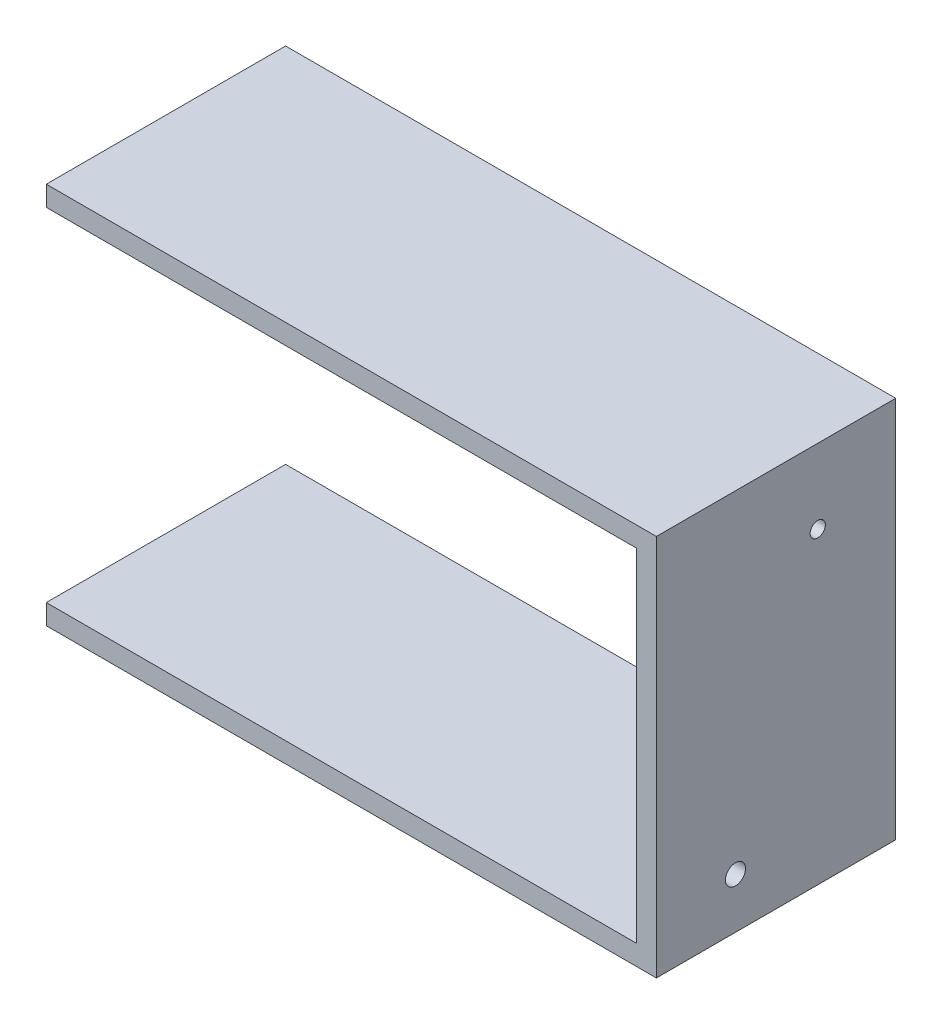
ISO-10303-21;
HEADER;
FILE_DESCRIPTION(('STEP AP214'),'2;1');
FILE_NAME('part.step','',(''),(''),'','','');
FILE_SCHEMA(('AUTOMOTIVE_DESIGN { 1 0 10303 214 1 1 1 1 }'));
ENDSEC;
DATA;
#1=APPLICATION_CONTEXT('core data for automotive mechanical design processes');
#2=APPLICATION_PROTOCOL_DEFINITION('international standard','automotive_design',2000,#1);
#3=PRODUCT_CONTEXT('',#1,'mechanical');
#4=PRODUCT('Part','Part','',(#3));
#5=PRODUCT_RELATED_PRODUCT_CATEGORY('part','',(#4));
#6=PRODUCT_DEFINITION_FORMATION('','',#4);
#7=PRODUCT_DEFINITION_CONTEXT('part definition',#1,'design');
#8=PRODUCT_DEFINITION('design','',#6,#7);
#9=PRODUCT_DEFINITION_SHAPE('','',#8);
#10=(LENGTH_UNIT() NAMED_UNIT(*) SI_UNIT(.MILLI.,.METRE.));
#11=(NAMED_UNIT(*) PLANE_ANGLE_UNIT() SI_UNIT($,.RADIAN.));
#12=(NAMED_UNIT(*) SI_UNIT($,.STERADIAN.) SOLID_ANGLE_UNIT());
#13=UNCERTAINTY_MEASURE_WITH_UNIT(LENGTH_MEASURE(1.E-05),#10,'distance_accuracy_value','');
#14=(GEOMETRIC_REPRESENTATION_CONTEXT(3) GLOBAL_UNCERTAINTY_ASSIGNED_CONTEXT((#13)) GLOBAL_UNIT_ASSIGNED_CONTEXT((#10,
#11,#12)) REPRESENTATION_CONTEXT('',''));
#15=CARTESIAN_POINT('',(0.,0.,0.));
#16=DIRECTION('',(0.,0.,1.));
#17=DIRECTION('',(1.,0.,0.));
#18=AXIS2_PLACEMENT_3D('',#15,#16,#17);
#19=CARTESIAN_POINT('',(0.,723.,452.5));
#20=DIRECTION('',(0.,0.,-1.));
#21=DIRECTION('',(-1.,0.,0.));
#22=AXIS2_PLACEMENT_3D('',#19,#20,#21);
#23=PLANE('',#22);
#24=DIRECTION('',(-1.,0.,0.));
#25=VECTOR('',#24,1.);
#26=CARTESIAN_POINT('',(0.,723.,452.5));
#27=LINE('',#26,#25);
#28=CARTESIAN_POINT('',(1191.5,723.,452.5));
#29=VERTEX_POINT('',#28);
#30=CARTESIAN_POINT('',(38.,723.,452.5));
#31=VERTEX_POINT('',#30);
#32=EDGE_CURVE('E139',#29,#31,#27,.T.);
#33=ORIENTED_EDGE('',*,*,#32,.T.);
#34=DIRECTION('',(0.,1.,0.));
#35=VECTOR('',#34,1.);
#36=CARTESIAN_POINT('',(38.,0.,452.5));
#37=LINE('',#36,#35);
#38=CARTESIAN_POINT('',(38.,685.,452.5));
#39=VERTEX_POINT('',#38);
#40=EDGE_CURVE('E113',#39,#31,#37,.T.);
#41=ORIENTED_EDGE('',*,*,#40,.F.);
#42=DIRECTION('',(-1.,0.,0.));
#43=VECTOR('',#42,1.);
#44=CARTESIAN_POINT('',(38.,685.,452.5));
#45=LINE('',#44,#43);
#46=CARTESIAN_POINT('',(1153.5,685.,452.5));
#47=VERTEX_POINT('',#46);
#48=EDGE_CURVE('E153',#47,#39,#45,.T.);
#49=ORIENTED_EDGE('',*,*,#48,.F.);
#50=DIRECTION('',(0.,1.,0.));
#51=VECTOR('',#50,1.);
#52=CARTESIAN_POINT('',(1153.5,38.,452.5));
#53=LINE('',#52,#51);
#54=CARTESIAN_POINT('',(1153.5,38.,452.5));
#55=VERTEX_POINT('',#54);
#56=EDGE_CURVE('E162',#55,#47,#53,.T.);
#57=ORIENTED_EDGE('',*,*,#56,.F.);
#58=DIRECTION('',(1.,0.,0.));
#59=VECTOR('',#58,1.);
#60=CARTESIAN_POINT('',(38.,38.,452.5));
#61=LINE('',#60,#59);
#62=CARTESIAN_POINT('',(38.,38.,452.5));
#63=VERTEX_POINT('',#62);
#64=EDGE_CURVE('E93',#63,#55,#61,.T.);
#65=ORIENTED_EDGE('',*,*,#64,.F.);
#66=CARTESIAN_POINT('',(38.,0.,452.5));
#67=VERTEX_POINT('',#66);
#68=EDGE_CURVE('E68',#67,#63,#37,.T.);
#69=ORIENTED_EDGE('',*,*,#68,.F.);
#70=DIRECTION('',(1.,0.,0.));
#71=VECTOR('',#70,1.);
#72=CARTESIAN_POINT('',(0.,0.,452.5));
#73=LINE('',#72,#71);
#74=CARTESIAN_POINT('',(1191.5,0.,452.5));
#75=VERTEX_POINT('',#74);
#76=EDGE_CURVE('E133',#67,#75,#73,.T.);
#77=ORIENTED_EDGE('',*,*,#76,.T.);
#78=DIRECTION('',(0.,1.,0.));
#79=VECTOR('',#78,1.);
#80=CARTESIAN_POINT('',(1191.5,0.,452.5));
#81=LINE('',#80,#79);
#82=EDGE_CURVE('E48',#75,#29,#81,.T.);
#83=ORIENTED_EDGE('',*,*,#82,.T.);
#84=EDGE_LOOP('',(#33,#41,#49,#57,#65,#69,#77,#83));
#85=FACE_BOUND('',#84,.T.);
#86=ADVANCED_FACE('F31',(#85),#23,.F.);
#87=CARTESIAN_POINT('',(0.,723.,0.));
#88=DIRECTION('',(0.,0.,-1.));
#89=DIRECTION('',(-1.,0.,0.));
#90=AXIS2_PLACEMENT_3D('',#87,#88,#89);
#91=PLANE('',#90);
#92=DIRECTION('',(0.,1.,0.));
#93=VECTOR('',#92,1.);
#94=CARTESIAN_POINT('',(38.,0.,0.));
#95=LINE('',#94,#93);
#96=CARTESIAN_POINT('',(38.,685.,0.));
#97=VERTEX_POINT('',#96);
#98=CARTESIAN_POINT('',(38.,723.,0.));
#99=VERTEX_POINT('',#98);
#100=EDGE_CURVE('E87',#97,#99,#95,.T.);
#101=ORIENTED_EDGE('',*,*,#100,.T.);
#102=DIRECTION('',(-1.,0.,0.));
#103=VECTOR('',#102,1.);
#104=CARTESIAN_POINT('',(0.,723.,0.));
#105=LINE('',#104,#103);
#106=CARTESIAN_POINT('',(1191.5,723.,0.));
#107=VERTEX_POINT('',#106);
#108=EDGE_CURVE('E125',#107,#99,#105,.T.);
#109=ORIENTED_EDGE('',*,*,#108,.F.);
#110=DIRECTION('',(0.,1.,0.));
#111=VECTOR('',#110,1.);
#112=CARTESIAN_POINT('',(1191.5,0.,0.));
#113=LINE('',#112,#111);
#114=CARTESIAN_POINT('',(1191.5,0.,0.));
#115=VERTEX_POINT('',#114);
#116=EDGE_CURVE('E134',#115,#107,#113,.T.);
#117=ORIENTED_EDGE('',*,*,#116,.F.);
#118=DIRECTION('',(1.,0.,0.));
#119=VECTOR('',#118,1.);
#120=CARTESIAN_POINT('',(0.,0.,0.));
#121=LINE('',#120,#119);
#122=CARTESIAN_POINT('',(38.,0.,0.));
#123=VERTEX_POINT('',#122);
#124=EDGE_CURVE('E59',#123,#115,#121,.T.);
#125=ORIENTED_EDGE('',*,*,#124,.F.);
#126=CARTESIAN_POINT('',(38.,38.,0.));
#127=VERTEX_POINT('',#126);
#128=EDGE_CURVE('E129',#123,#127,#95,.T.);
#129=ORIENTED_EDGE('',*,*,#128,.T.);
#130=DIRECTION('',(1.,0.,0.));
#131=VECTOR('',#130,1.);
#132=CARTESIAN_POINT('',(38.,38.,0.));
#133=LINE('',#132,#131);
#134=CARTESIAN_POINT('',(1153.5,38.,0.));
#135=VERTEX_POINT('',#134);
#136=EDGE_CURVE('E157',#127,#135,#133,.T.);
#137=ORIENTED_EDGE('',*,*,#136,.T.);
#138=DIRECTION('',(0.,1.,0.));
#139=VECTOR('',#138,1.);
#140=CARTESIAN_POINT('',(1153.5,38.,0.));
#141=LINE('',#140,#139);
#142=CARTESIAN_POINT('',(1153.5,685.,0.));
#143=VERTEX_POINT('',#142);
#144=EDGE_CURVE('E155',#135,#143,#141,.T.);
#145=ORIENTED_EDGE('',*,*,#144,.T.);
#146=DIRECTION('',(-1.,0.,0.));
#147=VECTOR('',#146,1.);
#148=CARTESIAN_POINT('',(38.,685.,0.));
#149=LINE('',#148,#147);
#150=EDGE_CURVE('E128',#143,#97,#149,.T.);
#151=ORIENTED_EDGE('',*,*,#150,.T.);
#152=EDGE_LOOP('',(#101,#109,#117,#125,#129,#137,#145,#151));
#153=FACE_BOUND('',#152,.T.);
#154=ADVANCED_FACE('F123',(#153),#91,.T.);
#155=CARTESIAN_POINT('',(0.,0.,452.5));
#156=DIRECTION('',(0.,1.,0.));
#157=DIRECTION('',(0.,0.,1.));
#158=AXIS2_PLACEMENT_3D('',#155,#156,#157);
#159=PLANE('',#158);
#160=ORIENTED_EDGE('',*,*,#76,.F.);
#161=DIRECTION('',(0.,0.,1.));
#162=VECTOR('',#161,1.);
#163=CARTESIAN_POINT('',(38.,0.,-0.000999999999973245));
#164=LINE('',#163,#162);
#165=EDGE_CURVE('E118',#123,#67,#164,.T.);
#166=ORIENTED_EDGE('',*,*,#165,.F.);
#167=ORIENTED_EDGE('',*,*,#124,.T.);
#168=DIRECTION('',(0.,0.,-1.));
#169=VECTOR('',#168,1.);
#170=CARTESIAN_POINT('',(1191.5,0.,452.5));
#171=LINE('',#170,#169);
#172=EDGE_CURVE('E11',#75,#115,#171,.T.);
#173=ORIENTED_EDGE('',*,*,#172,.F.);
#174=EDGE_LOOP('',(#160,#166,#167,#173));
#175=FACE_BOUND('',#174,.T.);
#176=ADVANCED_FACE('F33',(#175),#159,.F.);
#177=CARTESIAN_POINT('',(1191.5,0.,452.5));
#178=DIRECTION('',(-1.,0.,0.));
#179=DIRECTION('',(0.,0.,1.));
#180=AXIS2_PLACEMENT_3D('',#177,#178,#179);
#181=PLANE('',#180);
#182=CARTESIAN_POINT('',(1191.5,582.452,147.425));
#183=DIRECTION('',(1.,0.,0.));
#184=DIRECTION('',(0.,0.,-1.));
#185=AXIS2_PLACEMENT_3D('',#182,#183,#184);
#186=CIRCLE('',#185,14.35);
#187=CARTESIAN_POINT('',(1191.5,582.452,133.075));
#188=VERTEX_POINT('',#187);
#189=EDGE_CURVE('E171',#188,#188,#186,.T.);
#190=ORIENTED_EDGE('',*,*,#189,.F.);
#191=EDGE_LOOP('',(#190));
#192=FACE_BOUND('',#191,.T.);
#193=CARTESIAN_POINT('',(1191.5,95.,303.));
#194=DIRECTION('',(1.,0.,0.));
#195=DIRECTION('',(0.,0.,-1.));
#196=AXIS2_PLACEMENT_3D('',#193,#194,#195);
#197=CIRCLE('',#196,19.);
#198=CARTESIAN_POINT('',(1191.5,95.,284.));
#199=VERTEX_POINT('',#198);
#200=EDGE_CURVE('E165',#199,#199,#197,.T.);
#201=ORIENTED_EDGE('',*,*,#200,.F.);
#202=EDGE_LOOP('',(#201));
#203=FACE_BOUND('',#202,.T.);
#204=ORIENTED_EDGE('',*,*,#116,.T.);
#205=DIRECTION('',(0.,0.,-1.));
#206=VECTOR('',#205,1.);
#207=CARTESIAN_POINT('',(1191.5,723.,452.5));
#208=LINE('',#207,#206);
#209=EDGE_CURVE('E40',#29,#107,#208,.T.);
#210=ORIENTED_EDGE('',*,*,#209,.F.);
#211=ORIENTED_EDGE('',*,*,#82,.F.);
#212=ORIENTED_EDGE('',*,*,#172,.T.);
#213=EDGE_LOOP('',(#204,#210,#211,#212));
#214=FACE_BOUND('',#213,.T.);
#215=ADVANCED_FACE('F363',(#192,#203,#214),#181,.F.);
#216=CARTESIAN_POINT('',(0.,723.,452.5));
#217=DIRECTION('',(0.,-1.,0.));
#218=DIRECTION('',(0.,0.,-1.));
#219=AXIS2_PLACEMENT_3D('',#216,#217,#218);
#220=PLANE('',#219);
#221=ORIENTED_EDGE('',*,*,#108,.T.);
#222=DIRECTION('',(0.,0.,1.));
#223=VECTOR('',#222,1.);
#224=CARTESIAN_POINT('',(38.,723.,-0.000999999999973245));
#225=LINE('',#224,#223);
#226=EDGE_CURVE('E109',#99,#31,#225,.T.);
#227=ORIENTED_EDGE('',*,*,#226,.T.);
#228=ORIENTED_EDGE('',*,*,#32,.F.);
#229=ORIENTED_EDGE('',*,*,#209,.T.);
#230=EDGE_LOOP('',(#221,#227,#228,#229));
#231=FACE_BOUND('',#230,.T.);
#232=ADVANCED_FACE('F132',(#231),#220,.F.);
#233=CARTESIAN_POINT('',(38.,38.,452.5));
#234=DIRECTION('',(0.,1.,0.));
#235=DIRECTION('',(-1.,0.,0.));
#236=AXIS2_PLACEMENT_3D('',#233,#234,#235);
#237=PLANE('',#236);
#238=ORIENTED_EDGE('',*,*,#136,.F.);
#239=DIRECTION('',(0.,0.,-1.));
#240=VECTOR('',#239,1.);
#241=CARTESIAN_POINT('',(38.,38.,452.5));
#242=LINE('',#241,#240);
#243=EDGE_CURVE('E151',#63,#127,#242,.T.);
#244=ORIENTED_EDGE('',*,*,#243,.F.);
#245=ORIENTED_EDGE('',*,*,#64,.T.);
#246=DIRECTION('',(0.,0.,-1.));
#247=VECTOR('',#246,1.);
#248=CARTESIAN_POINT('',(1153.5,38.,452.5));
#249=LINE('',#248,#247);
#250=EDGE_CURVE('E142',#55,#135,#249,.T.);
#251=ORIENTED_EDGE('',*,*,#250,.T.);
#252=EDGE_LOOP('',(#238,#244,#245,#251));
#253=FACE_BOUND('',#252,.T.);
#254=ADVANCED_FACE('F333',(#253),#237,.T.);
#255=CARTESIAN_POINT('',(1153.5,38.,452.5));
#256=DIRECTION('',(-1.,0.,0.));
#257=DIRECTION('',(0.,0.,1.));
#258=AXIS2_PLACEMENT_3D('',#255,#256,#257);
#259=PLANE('',#258);
#260=CARTESIAN_POINT('',(1153.5,582.452,147.425));
#261=DIRECTION('',(1.,0.,0.));
#262=DIRECTION('',(0.,0.,-1.));
#263=AXIS2_PLACEMENT_3D('',#260,#261,#262);
#264=CIRCLE('',#263,14.35);
#265=CARTESIAN_POINT('',(1153.5,582.452,133.075));
#266=VERTEX_POINT('',#265);
#267=EDGE_CURVE('E168',#266,#266,#264,.T.);
#268=ORIENTED_EDGE('',*,*,#267,.T.);
#269=EDGE_LOOP('',(#268));
#270=FACE_BOUND('',#269,.T.);
#271=CARTESIAN_POINT('',(1153.5,95.,303.));
#272=DIRECTION('',(1.,0.,0.));
#273=DIRECTION('',(0.,0.,-1.));
#274=AXIS2_PLACEMENT_3D('',#271,#272,#273);
#275=CIRCLE('',#274,19.);
#276=CARTESIAN_POINT('',(1153.5,95.,284.));
#277=VERTEX_POINT('',#276);
#278=EDGE_CURVE('E159',#277,#277,#275,.T.);
#279=ORIENTED_EDGE('',*,*,#278,.T.);
#280=EDGE_LOOP('',(#279));
#281=FACE_BOUND('',#280,.T.);
#282=ORIENTED_EDGE('',*,*,#144,.F.);
#283=ORIENTED_EDGE('',*,*,#250,.F.);
#284=ORIENTED_EDGE('',*,*,#56,.T.);
#285=DIRECTION('',(0.,0.,-1.));
#286=VECTOR('',#285,1.);
#287=CARTESIAN_POINT('',(1153.5,685.,452.5));
#288=LINE('',#287,#286);
#289=EDGE_CURVE('E143',#47,#143,#288,.T.);
#290=ORIENTED_EDGE('',*,*,#289,.T.);
#291=EDGE_LOOP('',(#282,#283,#284,#290));
#292=FACE_BOUND('',#291,.T.);
#293=ADVANCED_FACE('F339',(#270,#281,#292),#259,.T.);
#294=CARTESIAN_POINT('',(38.,685.,452.5));
#295=DIRECTION('',(0.,-1.,0.));
#296=DIRECTION('',(0.,0.,-1.));
#297=AXIS2_PLACEMENT_3D('',#294,#295,#296);
#298=PLANE('',#297);
#299=ORIENTED_EDGE('',*,*,#150,.F.);
#300=ORIENTED_EDGE('',*,*,#289,.F.);
#301=ORIENTED_EDGE('',*,*,#48,.T.);
#302=DIRECTION('',(0.,0.,-1.));
#303=VECTOR('',#302,1.);
#304=CARTESIAN_POINT('',(38.,685.,452.5));
#305=LINE('',#304,#303);
#306=EDGE_CURVE('E147',#39,#97,#305,.T.);
#307=ORIENTED_EDGE('',*,*,#306,.T.);
#308=EDGE_LOOP('',(#299,#300,#301,#307));
#309=FACE_BOUND('',#308,.T.);
#310=ADVANCED_FACE('F341',(#309),#298,.T.);
#311=CARTESIAN_POINT('',(1153.5,95.,303.));
#312=DIRECTION('',(1.,0.,0.));
#313=DIRECTION('',(0.,0.,-1.));
#314=AXIS2_PLACEMENT_3D('',#311,#312,#313);
#315=CYLINDRICAL_SURFACE('',#314,19.);
#316=ORIENTED_EDGE('',*,*,#278,.F.);
#317=EDGE_LOOP('',(#316));
#318=FACE_BOUND('',#317,.T.);
#319=ORIENTED_EDGE('',*,*,#200,.T.);
#320=EDGE_LOOP('',(#319));
#321=FACE_BOUND('',#320,.T.);
#322=ADVANCED_FACE('F343',(#318,#321),#315,.F.);
#323=CARTESIAN_POINT('',(1153.5,582.452,147.425));
#324=DIRECTION('',(1.,0.,0.));
#325=DIRECTION('',(0.,0.,-1.));
#326=AXIS2_PLACEMENT_3D('',#323,#324,#325);
#327=CYLINDRICAL_SURFACE('',#326,14.35);
#328=ORIENTED_EDGE('',*,*,#267,.F.);
#329=EDGE_LOOP('',(#328));
#330=FACE_BOUND('',#329,.T.);
#331=ORIENTED_EDGE('',*,*,#189,.T.);
#332=EDGE_LOOP('',(#331));
#333=FACE_BOUND('',#332,.T.);
#334=ADVANCED_FACE('F349',(#330,#333),#327,.F.);
#335=CARTESIAN_POINT('',(38.,0.,-0.000999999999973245));
#336=DIRECTION('',(1.,0.,0.));
#337=DIRECTION('',(0.,1.,0.));
#338=AXIS2_PLACEMENT_3D('',#335,#336,#337);
#339=PLANE('',#338);
#340=ORIENTED_EDGE('',*,*,#243,.T.);
#341=ORIENTED_EDGE('',*,*,#128,.F.);
#342=ORIENTED_EDGE('',*,*,#165,.T.);
#343=ORIENTED_EDGE('',*,*,#68,.T.);
#344=EDGE_LOOP('',(#340,#341,#342,#343));
#345=FACE_BOUND('',#344,.T.);
#346=CARTESIAN_POINT('',(38.,11.7500000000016,10.2500000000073));
#347=DIRECTION('',(1.,0.,0.));
#348=DIRECTION('',(0.,1.,0.));
#349=AXIS2_PLACEMENT_3D('',#346,#347,#348);
#350=CIRCLE('',#349,4.76250000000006);
#351=CARTESIAN_POINT('',(38.,16.5125000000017,10.2500000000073));
#352=VERTEX_POINT('',#351);
#353=EDGE_CURVE('E293',#352,#352,#350,.T.);
#354=ORIENTED_EDGE('',*,*,#353,.T.);
#355=EDGE_LOOP('',(#354));
#356=FACE_BOUND('',#355,.T.);
#357=CARTESIAN_POINT('',(38.,11.7500000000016,82.2500000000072));
#358=DIRECTION('',(1.,0.,0.));
#359=DIRECTION('',(0.,1.,0.));
#360=AXIS2_PLACEMENT_3D('',#357,#358,#359);
#361=CIRCLE('',#360,4.76250000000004);
#362=CARTESIAN_POINT('',(38.,16.5125000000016,82.2500000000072));
#363=VERTEX_POINT('',#362);
#364=EDGE_CURVE('E299',#363,#363,#361,.T.);
#365=ORIENTED_EDGE('',*,*,#364,.T.);
#366=EDGE_LOOP('',(#365));
#367=FACE_BOUND('',#366,.T.);
#368=CARTESIAN_POINT('',(38.,11.7500000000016,154.250000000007));
#369=DIRECTION('',(1.,0.,0.));
#370=DIRECTION('',(0.,1.,0.));
#371=AXIS2_PLACEMENT_3D('',#368,#369,#370);
#372=CIRCLE('',#371,4.76250000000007);
#373=CARTESIAN_POINT('',(38.,16.5125000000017,154.250000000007));
#374=VERTEX_POINT('',#373);
#375=EDGE_CURVE('E305',#374,#374,#372,.T.);
#376=ORIENTED_EDGE('',*,*,#375,.T.);
#377=EDGE_LOOP('',(#376));
#378=FACE_BOUND('',#377,.T.);
#379=CARTESIAN_POINT('',(38.,11.7500000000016,226.250000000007));
#380=DIRECTION('',(1.,0.,0.));
#381=DIRECTION('',(0.,1.,0.));
#382=AXIS2_PLACEMENT_3D('',#379,#380,#381);
#383=CIRCLE('',#382,4.76250000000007);
#384=CARTESIAN_POINT('',(38.,16.5125000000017,226.250000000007));
#385=VERTEX_POINT('',#384);
#386=EDGE_CURVE('E311',#385,#385,#383,.T.);
#387=ORIENTED_EDGE('',*,*,#386,.T.);
#388=EDGE_LOOP('',(#387));
#389=FACE_BOUND('',#388,.T.);
#390=CARTESIAN_POINT('',(38.,11.7500000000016,298.250000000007));
#391=DIRECTION('',(1.,0.,0.));
#392=DIRECTION('',(0.,1.,0.));
#393=AXIS2_PLACEMENT_3D('',#390,#391,#392);
#394=CIRCLE('',#393,4.76250000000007);
#395=CARTESIAN_POINT('',(38.,16.5125000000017,298.250000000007));
#396=VERTEX_POINT('',#395);
#397=EDGE_CURVE('E317',#396,#396,#394,.T.);
#398=ORIENTED_EDGE('',*,*,#397,.T.);
#399=EDGE_LOOP('',(#398));
#400=FACE_BOUND('',#399,.T.);
#401=CARTESIAN_POINT('',(38.,11.7500000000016,370.250000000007));
#402=DIRECTION('',(1.,0.,0.));
#403=DIRECTION('',(0.,1.,0.));
#404=AXIS2_PLACEMENT_3D('',#401,#402,#403);
#405=CIRCLE('',#404,4.76250000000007);
#406=CARTESIAN_POINT('',(38.,16.5125000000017,370.250000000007));
#407=VERTEX_POINT('',#406);
#408=EDGE_CURVE('E323',#407,#407,#405,.T.);
#409=ORIENTED_EDGE('',*,*,#408,.T.);
#410=EDGE_LOOP('',(#409));
#411=FACE_BOUND('',#410,.T.);
#412=CARTESIAN_POINT('',(38.,11.7500000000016,442.250000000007));
#413=DIRECTION('',(1.,0.,0.));
#414=DIRECTION('',(0.,1.,0.));
#415=AXIS2_PLACEMENT_3D('',#412,#413,#414);
#416=CIRCLE('',#415,4.76250000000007);
#417=CARTESIAN_POINT('',(38.,16.5125000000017,442.250000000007));
#418=VERTEX_POINT('',#417);
#419=EDGE_CURVE('E117',#418,#418,#416,.T.);
#420=ORIENTED_EDGE('',*,*,#419,.T.);
#421=EDGE_LOOP('',(#420));
#422=FACE_BOUND('',#421,.T.);
#423=CARTESIAN_POINT('',(38.,11.7500000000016,406.250000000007));
#424=DIRECTION('',(1.,0.,0.));
#425=DIRECTION('',(0.,1.,0.));
#426=AXIS2_PLACEMENT_3D('',#423,#424,#425);
#427=CIRCLE('',#426,4.76250000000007);
#428=CARTESIAN_POINT('',(38.,16.5125000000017,406.250000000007));
#429=VERTEX_POINT('',#428);
#430=EDGE_CURVE('E326',#429,#429,#427,.T.);
#431=ORIENTED_EDGE('',*,*,#430,.T.);
#432=EDGE_LOOP('',(#431));
#433=FACE_BOUND('',#432,.T.);
#434=CARTESIAN_POINT('',(38.,11.7500000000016,334.250000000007));
#435=DIRECTION('',(1.,0.,0.));
#436=DIRECTION('',(0.,1.,0.));
#437=AXIS2_PLACEMENT_3D('',#434,#435,#436);
#438=CIRCLE('',#437,4.76250000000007);
#439=CARTESIAN_POINT('',(38.,16.5125000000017,334.250000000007));
#440=VERTEX_POINT('',#439);
#441=EDGE_CURVE('E320',#440,#440,#438,.T.);
#442=ORIENTED_EDGE('',*,*,#441,.T.);
#443=EDGE_LOOP('',(#442));
#444=FACE_BOUND('',#443,.T.);
#445=CARTESIAN_POINT('',(38.,11.7500000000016,262.250000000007));
#446=DIRECTION('',(1.,0.,0.));
#447=DIRECTION('',(0.,1.,0.));
#448=AXIS2_PLACEMENT_3D('',#445,#446,#447);
#449=CIRCLE('',#448,4.76250000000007);
#450=CARTESIAN_POINT('',(38.,16.5125000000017,262.250000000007));
#451=VERTEX_POINT('',#450);
#452=EDGE_CURVE('E314',#451,#451,#449,.T.);
#453=ORIENTED_EDGE('',*,*,#452,.T.);
#454=EDGE_LOOP('',(#453));
#455=FACE_BOUND('',#454,.T.);
#456=CARTESIAN_POINT('',(38.,11.7500000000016,190.250000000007));
#457=DIRECTION('',(1.,0.,0.));
#458=DIRECTION('',(0.,1.,0.));
#459=AXIS2_PLACEMENT_3D('',#456,#457,#458);
#460=CIRCLE('',#459,4.76250000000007);
#461=CARTESIAN_POINT('',(38.,16.5125000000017,190.250000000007));
#462=VERTEX_POINT('',#461);
#463=EDGE_CURVE('E308',#462,#462,#460,.T.);
#464=ORIENTED_EDGE('',*,*,#463,.T.);
#465=EDGE_LOOP('',(#464));
#466=FACE_BOUND('',#465,.T.);
#467=CARTESIAN_POINT('',(38.,11.7500000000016,118.250000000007));
#468=DIRECTION('',(1.,0.,0.));
#469=DIRECTION('',(0.,1.,0.));
#470=AXIS2_PLACEMENT_3D('',#467,#468,#469);
#471=CIRCLE('',#470,4.76250000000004);
#472=CARTESIAN_POINT('',(38.,16.5125000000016,118.250000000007));
#473=VERTEX_POINT('',#472);
#474=EDGE_CURVE('E302',#473,#473,#471,.T.);
#475=ORIENTED_EDGE('',*,*,#474,.T.);
#476=EDGE_LOOP('',(#475));
#477=FACE_BOUND('',#476,.T.);
#478=CARTESIAN_POINT('',(38.,11.7500000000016,46.2500000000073));
#479=DIRECTION('',(1.,0.,0.));
#480=DIRECTION('',(0.,1.,0.));
#481=AXIS2_PLACEMENT_3D('',#478,#479,#480);
#482=CIRCLE('',#481,4.76250000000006);
#483=CARTESIAN_POINT('',(38.,16.5125000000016,46.2500000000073));
#484=VERTEX_POINT('',#483);
#485=EDGE_CURVE('E296',#484,#484,#482,.T.);
#486=ORIENTED_EDGE('',*,*,#485,.T.);
#487=EDGE_LOOP('',(#486));
#488=FACE_BOUND('',#487,.T.);
#489=ADVANCED_FACE('F373',(#345,#356,#367,#378,#389,#400,#411,#422,#433,#444,#455,#466,#477,
#488),#339,.F.);
#490=CARTESIAN_POINT('',(70.,11.7500000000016,406.250000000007));
#491=DIRECTION('',(-1.,0.,0.));
#492=DIRECTION('',(0.,0.,1.));
#493=AXIS2_PLACEMENT_3D('',#490,#491,#492);
#494=PLANE('',#493);
#495=CARTESIAN_POINT('',(70.,11.7500000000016,406.250000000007));
#496=DIRECTION('',(-1.,0.,0.));
#497=DIRECTION('',(0.,0.,1.));
#498=AXIS2_PLACEMENT_3D('',#495,#496,#497);
#499=CIRCLE('',#498,4.76250000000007);
#500=CARTESIAN_POINT('',(70.,11.7500000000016,411.012500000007));
#501=VERTEX_POINT('',#500);
#502=EDGE_CURVE('E248',#501,#501,#499,.T.);
#503=ORIENTED_EDGE('',*,*,#502,.T.);
#504=EDGE_LOOP('',(#503));
#505=FACE_BOUND('',#504,.T.);
#506=ADVANCED_FACE('F376',(#505),#494,.T.);
#507=CARTESIAN_POINT('',(70.,11.7500000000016,406.250000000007));
#508=DIRECTION('',(-1.,0.,0.));
#509=DIRECTION('',(0.,0.,1.));
#510=AXIS2_PLACEMENT_3D('',#507,#508,#509);
#511=CYLINDRICAL_SURFACE('',#510,4.76250000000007);
#512=ORIENTED_EDGE('',*,*,#430,.F.);
#513=EDGE_LOOP('',(#512));
#514=FACE_BOUND('',#513,.T.);
#515=ORIENTED_EDGE('',*,*,#502,.F.);
#516=EDGE_LOOP('',(#515));
#517=FACE_BOUND('',#516,.T.);
#518=ADVANCED_FACE('F559',(#514,#517),#511,.F.);
#519=CARTESIAN_POINT('',(70.,11.7500000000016,370.250000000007));
#520=DIRECTION('',(-1.,0.,0.));
#521=DIRECTION('',(0.,0.,1.));
#522=AXIS2_PLACEMENT_3D('',#519,#520,#521);
#523=PLANE('',#522);
#524=CARTESIAN_POINT('',(70.,11.7500000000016,370.250000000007));
#525=DIRECTION('',(-1.,0.,0.));
#526=DIRECTION('',(0.,0.,1.));
#527=AXIS2_PLACEMENT_3D('',#524,#525,#526);
#528=CIRCLE('',#527,4.76250000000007);
#529=CARTESIAN_POINT('',(70.,11.7500000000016,375.012500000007));
#530=VERTEX_POINT('',#529);
#531=EDGE_CURVE('E245',#530,#530,#528,.T.);
#532=ORIENTED_EDGE('',*,*,#531,.T.);
#533=EDGE_LOOP('',(#532));
#534=FACE_BOUND('',#533,.T.);
#535=ADVANCED_FACE('F568',(#534),#523,.T.);
#536=CARTESIAN_POINT('',(70.,11.7500000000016,370.250000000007));
#537=DIRECTION('',(-1.,0.,0.));
#538=DIRECTION('',(0.,0.,1.));
#539=AXIS2_PLACEMENT_3D('',#536,#537,#538);
#540=CYLINDRICAL_SURFACE('',#539,4.76250000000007);
#541=ORIENTED_EDGE('',*,*,#408,.F.);
#542=EDGE_LOOP('',(#541));
#543=FACE_BOUND('',#542,.T.);
#544=ORIENTED_EDGE('',*,*,#531,.F.);
#545=EDGE_LOOP('',(#544));
#546=FACE_BOUND('',#545,.T.);
#547=ADVANCED_FACE('F576',(#543,#546),#540,.F.);
#548=CARTESIAN_POINT('',(70.,11.7500000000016,334.250000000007));
#549=DIRECTION('',(-1.,0.,0.));
#550=DIRECTION('',(0.,0.,1.));
#551=AXIS2_PLACEMENT_3D('',#548,#549,#550);
#552=PLANE('',#551);
#553=CARTESIAN_POINT('',(70.,11.7500000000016,334.250000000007));
#554=DIRECTION('',(-1.,0.,0.));
#555=DIRECTION('',(0.,0.,1.));
#556=AXIS2_PLACEMENT_3D('',#553,#554,#555);
#557=CIRCLE('',#556,4.76250000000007);
#558=CARTESIAN_POINT('',(70.,11.7500000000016,339.012500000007));
#559=VERTEX_POINT('',#558);
#560=EDGE_CURVE('E242',#559,#559,#557,.T.);
#561=ORIENTED_EDGE('',*,*,#560,.T.);
#562=EDGE_LOOP('',(#561));
#563=FACE_BOUND('',#562,.T.);
#564=ADVANCED_FACE('F584',(#563),#552,.T.);
#565=CARTESIAN_POINT('',(70.,11.7500000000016,334.250000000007));
#566=DIRECTION('',(-1.,0.,0.));
#567=DIRECTION('',(0.,0.,1.));
#568=AXIS2_PLACEMENT_3D('',#565,#566,#567);
#569=CYLINDRICAL_SURFACE('',#568,4.76250000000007);
#570=ORIENTED_EDGE('',*,*,#441,.F.);
#571=EDGE_LOOP('',(#570));
#572=FACE_BOUND('',#571,.T.);
#573=ORIENTED_EDGE('',*,*,#560,.F.);
#574=EDGE_LOOP('',(#573));
#575=FACE_BOUND('',#574,.T.);
#576=ADVANCED_FACE('F592',(#572,#575),#569,.F.);
#577=CARTESIAN_POINT('',(70.,11.7500000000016,298.250000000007));
#578=DIRECTION('',(-1.,0.,0.));
#579=DIRECTION('',(0.,0.,1.));
#580=AXIS2_PLACEMENT_3D('',#577,#578,#579);
#581=PLANE('',#580);
#582=CARTESIAN_POINT('',(70.,11.7500000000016,298.250000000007));
#583=DIRECTION('',(-1.,0.,0.));
#584=DIRECTION('',(0.,0.,1.));
#585=AXIS2_PLACEMENT_3D('',#582,#583,#584);
#586=CIRCLE('',#585,4.76250000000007);
#587=CARTESIAN_POINT('',(70.,11.7500000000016,303.012500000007));
#588=VERTEX_POINT('',#587);
#589=EDGE_CURVE('E239',#588,#588,#586,.T.);
#590=ORIENTED_EDGE('',*,*,#589,.T.);
#591=EDGE_LOOP('',(#590));
#592=FACE_BOUND('',#591,.T.);
#593=ADVANCED_FACE('F600',(#592),#581,.T.);
#594=CARTESIAN_POINT('',(70.,11.7500000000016,298.250000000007));
#595=DIRECTION('',(-1.,0.,0.));
#596=DIRECTION('',(0.,0.,1.));
#597=AXIS2_PLACEMENT_3D('',#594,#595,#596);
#598=CYLINDRICAL_SURFACE('',#597,4.76250000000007);
#599=ORIENTED_EDGE('',*,*,#397,.F.);
#600=EDGE_LOOP('',(#599));
#601=FACE_BOUND('',#600,.T.);
#602=ORIENTED_EDGE('',*,*,#589,.F.);
#603=EDGE_LOOP('',(#602));
#604=FACE_BOUND('',#603,.T.);
#605=ADVANCED_FACE('F608',(#601,#604),#598,.F.);
#606=CARTESIAN_POINT('',(70.,11.7500000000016,262.250000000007));
#607=DIRECTION('',(-1.,0.,0.));
#608=DIRECTION('',(0.,0.,1.));
#609=AXIS2_PLACEMENT_3D('',#606,#607,#608);
#610=PLANE('',#609);
#611=CARTESIAN_POINT('',(70.,11.7500000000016,262.250000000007));
#612=DIRECTION('',(-1.,0.,0.));
#613=DIRECTION('',(0.,0.,1.));
#614=AXIS2_PLACEMENT_3D('',#611,#612,#613);
#615=CIRCLE('',#614,4.76250000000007);
#616=CARTESIAN_POINT('',(70.,11.7500000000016,267.012500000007));
#617=VERTEX_POINT('',#616);
#618=EDGE_CURVE('E236',#617,#617,#615,.T.);
#619=ORIENTED_EDGE('',*,*,#618,.T.);
#620=EDGE_LOOP('',(#619));
#621=FACE_BOUND('',#620,.T.);
#622=ADVANCED_FACE('F616',(#621),#610,.T.);
#623=CARTESIAN_POINT('',(70.,11.7500000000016,262.250000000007));
#624=DIRECTION('',(-1.,0.,0.));
#625=DIRECTION('',(0.,0.,1.));
#626=AXIS2_PLACEMENT_3D('',#623,#624,#625);
#627=CYLINDRICAL_SURFACE('',#626,4.76250000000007);
#628=ORIENTED_EDGE('',*,*,#452,.F.);
#629=EDGE_LOOP('',(#628));
#630=FACE_BOUND('',#629,.T.);
#631=ORIENTED_EDGE('',*,*,#618,.F.);
#632=EDGE_LOOP('',(#631));
#633=FACE_BOUND('',#632,.T.);
#634=ADVANCED_FACE('F624',(#630,#633),#627,.F.);
#635=CARTESIAN_POINT('',(70.,11.7500000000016,226.250000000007));
#636=DIRECTION('',(-1.,0.,0.));
#637=DIRECTION('',(0.,0.,1.));
#638=AXIS2_PLACEMENT_3D('',#635,#636,#637);
#639=PLANE('',#638);
#640=CARTESIAN_POINT('',(70.,11.7500000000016,226.250000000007));
#641=DIRECTION('',(-1.,0.,0.));
#642=DIRECTION('',(0.,0.,1.));
#643=AXIS2_PLACEMENT_3D('',#640,#641,#642);
#644=CIRCLE('',#643,4.76250000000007);
#645=CARTESIAN_POINT('',(70.,11.7500000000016,231.012500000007));
#646=VERTEX_POINT('',#645);
#647=EDGE_CURVE('E233',#646,#646,#644,.T.);
#648=ORIENTED_EDGE('',*,*,#647,.T.);
#649=EDGE_LOOP('',(#648));
#650=FACE_BOUND('',#649,.T.);
#651=ADVANCED_FACE('F632',(#650),#639,.T.);
#652=CARTESIAN_POINT('',(70.,11.7500000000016,226.250000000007));
#653=DIRECTION('',(-1.,0.,0.));
#654=DIRECTION('',(0.,0.,1.));
#655=AXIS2_PLACEMENT_3D('',#652,#653,#654);
#656=CYLINDRICAL_SURFACE('',#655,4.76250000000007);
#657=ORIENTED_EDGE('',*,*,#386,.F.);
#658=EDGE_LOOP('',(#657));
#659=FACE_BOUND('',#658,.T.);
#660=ORIENTED_EDGE('',*,*,#647,.F.);
#661=EDGE_LOOP('',(#660));
#662=FACE_BOUND('',#661,.T.);
#663=ADVANCED_FACE('F640',(#659,#662),#656,.F.);
#664=CARTESIAN_POINT('',(70.,11.7500000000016,190.250000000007));
#665=DIRECTION('',(-1.,0.,0.));
#666=DIRECTION('',(0.,0.,1.));
#667=AXIS2_PLACEMENT_3D('',#664,#665,#666);
#668=PLANE('',#667);
#669=CARTESIAN_POINT('',(70.,11.7500000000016,190.250000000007));
#670=DIRECTION('',(-1.,0.,0.));
#671=DIRECTION('',(0.,0.,1.));
#672=AXIS2_PLACEMENT_3D('',#669,#670,#671);
#673=CIRCLE('',#672,4.76250000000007);
#674=CARTESIAN_POINT('',(70.,11.7500000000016,195.012500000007));
#675=VERTEX_POINT('',#674);
#676=EDGE_CURVE('E230',#675,#675,#673,.T.);
#677=ORIENTED_EDGE('',*,*,#676,.T.);
#678=EDGE_LOOP('',(#677));
#679=FACE_BOUND('',#678,.T.);
#680=ADVANCED_FACE('F648',(#679),#668,.T.);
#681=CARTESIAN_POINT('',(70.,11.7500000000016,190.250000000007));
#682=DIRECTION('',(-1.,0.,0.));
#683=DIRECTION('',(0.,0.,1.));
#684=AXIS2_PLACEMENT_3D('',#681,#682,#683);
#685=CYLINDRICAL_SURFACE('',#684,4.76250000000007);
#686=ORIENTED_EDGE('',*,*,#463,.F.);
#687=EDGE_LOOP('',(#686));
#688=FACE_BOUND('',#687,.T.);
#689=ORIENTED_EDGE('',*,*,#676,.F.);
#690=EDGE_LOOP('',(#689));
#691=FACE_BOUND('',#690,.T.);
#692=ADVANCED_FACE('F656',(#688,#691),#685,.F.);
#693=CARTESIAN_POINT('',(70.,11.7500000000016,154.250000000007));
#694=DIRECTION('',(-1.,0.,0.));
#695=DIRECTION('',(0.,0.,1.));
#696=AXIS2_PLACEMENT_3D('',#693,#694,#695);
#697=PLANE('',#696);
#698=CARTESIAN_POINT('',(70.,11.7500000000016,154.250000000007));
#699=DIRECTION('',(-1.,0.,0.));
#700=DIRECTION('',(0.,0.,1.));
#701=AXIS2_PLACEMENT_3D('',#698,#699,#700);
#702=CIRCLE('',#701,4.76250000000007);
#703=CARTESIAN_POINT('',(70.,11.7500000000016,159.012500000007));
#704=VERTEX_POINT('',#703);
#705=EDGE_CURVE('E227',#704,#704,#702,.T.);
#706=ORIENTED_EDGE('',*,*,#705,.T.);
#707=EDGE_LOOP('',(#706));
#708=FACE_BOUND('',#707,.T.);
#709=ADVANCED_FACE('F664',(#708),#697,.T.);
#710=CARTESIAN_POINT('',(70.,11.7500000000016,154.250000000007));
#711=DIRECTION('',(-1.,0.,0.));
#712=DIRECTION('',(0.,0.,1.));
#713=AXIS2_PLACEMENT_3D('',#710,#711,#712);
#714=CYLINDRICAL_SURFACE('',#713,4.76250000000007);
#715=ORIENTED_EDGE('',*,*,#375,.F.);
#716=EDGE_LOOP('',(#715));
#717=FACE_BOUND('',#716,.T.);
#718=ORIENTED_EDGE('',*,*,#705,.F.);
#719=EDGE_LOOP('',(#718));
#720=FACE_BOUND('',#719,.T.);
#721=ADVANCED_FACE('F672',(#717,#720),#714,.F.);
#722=CARTESIAN_POINT('',(70.,11.7500000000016,118.250000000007));
#723=DIRECTION('',(-1.,0.,0.));
#724=DIRECTION('',(0.,0.,1.));
#725=AXIS2_PLACEMENT_3D('',#722,#723,#724);
#726=PLANE('',#725);
#727=CARTESIAN_POINT('',(70.,11.7500000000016,118.250000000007));
#728=DIRECTION('',(-1.,0.,0.));
#729=DIRECTION('',(0.,0.,1.));
#730=AXIS2_PLACEMENT_3D('',#727,#728,#729);
#731=CIRCLE('',#730,4.76250000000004);
#732=CARTESIAN_POINT('',(70.,11.7500000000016,123.012500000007));
#733=VERTEX_POINT('',#732);
#734=EDGE_CURVE('E224',#733,#733,#731,.T.);
#735=ORIENTED_EDGE('',*,*,#734,.T.);
#736=EDGE_LOOP('',(#735));
#737=FACE_BOUND('',#736,.T.);
#738=ADVANCED_FACE('F680',(#737),#726,.T.);
#739=CARTESIAN_POINT('',(70.,11.7500000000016,118.250000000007));
#740=DIRECTION('',(-1.,0.,0.));
#741=DIRECTION('',(0.,0.,1.));
#742=AXIS2_PLACEMENT_3D('',#739,#740,#741);
#743=CYLINDRICAL_SURFACE('',#742,4.76250000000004);
#744=ORIENTED_EDGE('',*,*,#474,.F.);
#745=EDGE_LOOP('',(#744));
#746=FACE_BOUND('',#745,.T.);
#747=ORIENTED_EDGE('',*,*,#734,.F.);
#748=EDGE_LOOP('',(#747));
#749=FACE_BOUND('',#748,.T.);
#750=ADVANCED_FACE('F688',(#746,#749),#743,.F.);
#751=CARTESIAN_POINT('',(70.,11.7500000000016,82.2500000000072));
#752=DIRECTION('',(-1.,0.,0.));
#753=DIRECTION('',(0.,0.,1.));
#754=AXIS2_PLACEMENT_3D('',#751,#752,#753);
#755=PLANE('',#754);
#756=CARTESIAN_POINT('',(70.,11.7500000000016,82.2500000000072));
#757=DIRECTION('',(-1.,0.,0.));
#758=DIRECTION('',(0.,0.,1.));
#759=AXIS2_PLACEMENT_3D('',#756,#757,#758);
#760=CIRCLE('',#759,4.76250000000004);
#761=CARTESIAN_POINT('',(70.,11.7500000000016,87.0125000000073));
#762=VERTEX_POINT('',#761);
#763=EDGE_CURVE('E221',#762,#762,#760,.T.);
#764=ORIENTED_EDGE('',*,*,#763,.T.);
#765=EDGE_LOOP('',(#764));
#766=FACE_BOUND('',#765,.T.);
#767=ADVANCED_FACE('F418',(#766),#755,.T.);
#768=CARTESIAN_POINT('',(70.,11.7500000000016,82.2500000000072));
#769=DIRECTION('',(-1.,0.,0.));
#770=DIRECTION('',(0.,0.,1.));
#771=AXIS2_PLACEMENT_3D('',#768,#769,#770);
#772=CYLINDRICAL_SURFACE('',#771,4.76250000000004);
#773=ORIENTED_EDGE('',*,*,#364,.F.);
#774=EDGE_LOOP('',(#773));
#775=FACE_BOUND('',#774,.T.);
#776=ORIENTED_EDGE('',*,*,#763,.F.);
#777=EDGE_LOOP('',(#776));
#778=FACE_BOUND('',#777,.T.);
#779=ADVANCED_FACE('F413',(#775,#778),#772,.F.);
#780=CARTESIAN_POINT('',(70.,11.7500000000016,46.2500000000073));
#781=DIRECTION('',(-1.,0.,0.));
#782=DIRECTION('',(0.,0.,1.));
#783=AXIS2_PLACEMENT_3D('',#780,#781,#782);
#784=PLANE('',#783);
#785=CARTESIAN_POINT('',(70.,11.7500000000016,46.2500000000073));
#786=DIRECTION('',(-1.,0.,0.));
#787=DIRECTION('',(0.,0.,1.));
#788=AXIS2_PLACEMENT_3D('',#785,#786,#787);
#789=CIRCLE('',#788,4.76250000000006);
#790=CARTESIAN_POINT('',(70.,11.7500000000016,51.0125000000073));
#791=VERTEX_POINT('',#790);
#792=EDGE_CURVE('E218',#791,#791,#789,.T.);
#793=ORIENTED_EDGE('',*,*,#792,.T.);
#794=EDGE_LOOP('',(#793));
#795=FACE_BOUND('',#794,.T.);
#796=ADVANCED_FACE('F408',(#795),#784,.T.);
#797=CARTESIAN_POINT('',(70.,11.7500000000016,46.2500000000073));
#798=DIRECTION('',(-1.,0.,0.));
#799=DIRECTION('',(0.,0.,1.));
#800=AXIS2_PLACEMENT_3D('',#797,#798,#799);
#801=CYLINDRICAL_SURFACE('',#800,4.76250000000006);
#802=ORIENTED_EDGE('',*,*,#485,.F.);
#803=EDGE_LOOP('',(#802));
#804=FACE_BOUND('',#803,.T.);
#805=ORIENTED_EDGE('',*,*,#792,.F.);
#806=EDGE_LOOP('',(#805));
#807=FACE_BOUND('',#806,.T.);
#808=ADVANCED_FACE('F404',(#804,#807),#801,.F.);
#809=CARTESIAN_POINT('',(70.,11.7500000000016,10.2500000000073));
#810=DIRECTION('',(-1.,0.,0.));
#811=DIRECTION('',(0.,0.,1.));
#812=AXIS2_PLACEMENT_3D('',#809,#810,#811);
#813=PLANE('',#812);
#814=CARTESIAN_POINT('',(70.,11.7500000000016,10.2500000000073));
#815=DIRECTION('',(-1.,0.,0.));
#816=DIRECTION('',(0.,0.,1.));
#817=AXIS2_PLACEMENT_3D('',#814,#815,#816);
#818=CIRCLE('',#817,4.76250000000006);
#819=CARTESIAN_POINT('',(70.,11.7500000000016,15.0125000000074));
#820=VERTEX_POINT('',#819);
#821=EDGE_CURVE('E215',#820,#820,#818,.T.);
#822=ORIENTED_EDGE('',*,*,#821,.T.);
#823=EDGE_LOOP('',(#822));
#824=FACE_BOUND('',#823,.T.);
#825=ADVANCED_FACE('F407',(#824),#813,.T.);
#826=CARTESIAN_POINT('',(70.,11.7500000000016,10.2500000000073));
#827=DIRECTION('',(-1.,0.,0.));
#828=DIRECTION('',(0.,0.,1.));
#829=AXIS2_PLACEMENT_3D('',#826,#827,#828);
#830=CYLINDRICAL_SURFACE('',#829,4.76250000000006);
#831=ORIENTED_EDGE('',*,*,#353,.F.);
#832=EDGE_LOOP('',(#831));
#833=FACE_BOUND('',#832,.T.);
#834=ORIENTED_EDGE('',*,*,#821,.F.);
#835=EDGE_LOOP('',(#834));
#836=FACE_BOUND('',#835,.T.);
#837=ADVANCED_FACE('F425',(#833,#836),#830,.F.);
#838=ORIENTED_EDGE('',*,*,#306,.F.);
#839=ORIENTED_EDGE('',*,*,#40,.T.);
#840=ORIENTED_EDGE('',*,*,#226,.F.);
#841=ORIENTED_EDGE('',*,*,#100,.F.);
#842=EDGE_LOOP('',(#838,#839,#840,#841));
#843=FACE_BOUND('',#842,.T.);
#844=CARTESIAN_POINT('',(38.,711.75,46.25));
#845=DIRECTION('',(1.,0.,0.));
#846=DIRECTION('',(0.,1.,0.));
#847=AXIS2_PLACEMENT_3D('',#844,#845,#846);
#848=CIRCLE('',#847,4.76250000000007);
#849=CARTESIAN_POINT('',(38.,716.5125,46.25));
#850=VERTEX_POINT('',#849);
#851=EDGE_CURVE('E257',#850,#850,#848,.T.);
#852=ORIENTED_EDGE('',*,*,#851,.T.);
#853=EDGE_LOOP('',(#852));
#854=FACE_BOUND('',#853,.T.);
#855=CARTESIAN_POINT('',(38.,711.75,118.25));
#856=DIRECTION('',(1.,0.,0.));
#857=DIRECTION('',(0.,1.,0.));
#858=AXIS2_PLACEMENT_3D('',#855,#856,#857);
#859=CIRCLE('',#858,4.76250000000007);
#860=CARTESIAN_POINT('',(38.,716.5125,118.25));
#861=VERTEX_POINT('',#860);
#862=EDGE_CURVE('E263',#861,#861,#859,.T.);
#863=ORIENTED_EDGE('',*,*,#862,.T.);
#864=EDGE_LOOP('',(#863));
#865=FACE_BOUND('',#864,.T.);
#866=CARTESIAN_POINT('',(38.,711.75,190.25));
#867=DIRECTION('',(1.,0.,0.));
#868=DIRECTION('',(0.,1.,0.));
#869=AXIS2_PLACEMENT_3D('',#866,#867,#868);
#870=CIRCLE('',#869,4.7625000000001);
#871=CARTESIAN_POINT('',(38.,716.5125,190.25));
#872=VERTEX_POINT('',#871);
#873=EDGE_CURVE('E269',#872,#872,#870,.T.);
#874=ORIENTED_EDGE('',*,*,#873,.T.);
#875=EDGE_LOOP('',(#874));
#876=FACE_BOUND('',#875,.T.);
#877=CARTESIAN_POINT('',(38.,711.75,262.25));
#878=DIRECTION('',(1.,0.,0.));
#879=DIRECTION('',(0.,1.,0.));
#880=AXIS2_PLACEMENT_3D('',#877,#878,#879);
#881=CIRCLE('',#880,4.76250000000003);
#882=CARTESIAN_POINT('',(38.,716.5125,262.25));
#883=VERTEX_POINT('',#882);
#884=EDGE_CURVE('E275',#883,#883,#881,.T.);
#885=ORIENTED_EDGE('',*,*,#884,.T.);
#886=EDGE_LOOP('',(#885));
#887=FACE_BOUND('',#886,.T.);
#888=CARTESIAN_POINT('',(38.,711.75,334.25));
#889=DIRECTION('',(1.,0.,0.));
#890=DIRECTION('',(0.,1.,0.));
#891=AXIS2_PLACEMENT_3D('',#888,#889,#890);
#892=CIRCLE('',#891,4.76250000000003);
#893=CARTESIAN_POINT('',(38.,716.5125,334.25));
#894=VERTEX_POINT('',#893);
#895=EDGE_CURVE('E281',#894,#894,#892,.T.);
#896=ORIENTED_EDGE('',*,*,#895,.T.);
#897=EDGE_LOOP('',(#896));
#898=FACE_BOUND('',#897,.T.);
#899=CARTESIAN_POINT('',(38.,711.75,406.25));
#900=DIRECTION('',(1.,0.,0.));
#901=DIRECTION('',(0.,1.,0.));
#902=AXIS2_PLACEMENT_3D('',#899,#900,#901);
#903=CIRCLE('',#902,4.76250000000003);
#904=CARTESIAN_POINT('',(38.,716.5125,406.25));
#905=VERTEX_POINT('',#904);
#906=EDGE_CURVE('E287',#905,#905,#903,.T.);
#907=ORIENTED_EDGE('',*,*,#906,.T.);
#908=EDGE_LOOP('',(#907));
#909=FACE_BOUND('',#908,.T.);
#910=CARTESIAN_POINT('',(38.,711.75,442.25));
#911=DIRECTION('',(1.,0.,0.));
#912=DIRECTION('',(0.,1.,0.));
#913=AXIS2_PLACEMENT_3D('',#910,#911,#912);
#914=CIRCLE('',#913,4.76250000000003);
#915=CARTESIAN_POINT('',(38.,716.5125,442.25));
#916=VERTEX_POINT('',#915);
#917=EDGE_CURVE('E290',#916,#916,#914,.T.);
#918=ORIENTED_EDGE('',*,*,#917,.T.);
#919=EDGE_LOOP('',(#918));
#920=FACE_BOUND('',#919,.T.);
#921=CARTESIAN_POINT('',(38.,711.75,370.25));
#922=DIRECTION('',(1.,0.,0.));
#923=DIRECTION('',(0.,1.,0.));
#924=AXIS2_PLACEMENT_3D('',#921,#922,#923);
#925=CIRCLE('',#924,4.76250000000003);
#926=CARTESIAN_POINT('',(38.,716.5125,370.25));
#927=VERTEX_POINT('',#926);
#928=EDGE_CURVE('E284',#927,#927,#925,.T.);
#929=ORIENTED_EDGE('',*,*,#928,.T.);
#930=EDGE_LOOP('',(#929));
#931=FACE_BOUND('',#930,.T.);
#932=CARTESIAN_POINT('',(38.,711.75,298.25));
#933=DIRECTION('',(1.,0.,0.));
#934=DIRECTION('',(0.,1.,0.));
#935=AXIS2_PLACEMENT_3D('',#932,#933,#934);
#936=CIRCLE('',#935,4.76250000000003);
#937=CARTESIAN_POINT('',(38.,716.5125,298.25));
#938=VERTEX_POINT('',#937);
#939=EDGE_CURVE('E278',#938,#938,#936,.T.);
#940=ORIENTED_EDGE('',*,*,#939,.T.);
#941=EDGE_LOOP('',(#940));
#942=FACE_BOUND('',#941,.T.);
#943=CARTESIAN_POINT('',(38.,711.75,226.25));
#944=DIRECTION('',(1.,0.,0.));
#945=DIRECTION('',(0.,1.,0.));
#946=AXIS2_PLACEMENT_3D('',#943,#944,#945);
#947=CIRCLE('',#946,4.7625000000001);
#948=CARTESIAN_POINT('',(38.,716.5125,226.25));
#949=VERTEX_POINT('',#948);
#950=EDGE_CURVE('E272',#949,#949,#947,.T.);
#951=ORIENTED_EDGE('',*,*,#950,.T.);
#952=EDGE_LOOP('',(#951));
#953=FACE_BOUND('',#952,.T.);
#954=CARTESIAN_POINT('',(38.,711.75,154.25));
#955=DIRECTION('',(1.,0.,0.));
#956=DIRECTION('',(0.,1.,0.));
#957=AXIS2_PLACEMENT_3D('',#954,#955,#956);
#958=CIRCLE('',#957,4.7625000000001);
#959=CARTESIAN_POINT('',(38.,716.5125,154.25));
#960=VERTEX_POINT('',#959);
#961=EDGE_CURVE('E266',#960,#960,#958,.T.);
#962=ORIENTED_EDGE('',*,*,#961,.T.);
#963=EDGE_LOOP('',(#962));
#964=FACE_BOUND('',#963,.T.);
#965=CARTESIAN_POINT('',(38.,711.75,82.25));
#966=DIRECTION('',(1.,0.,0.));
#967=DIRECTION('',(0.,1.,0.));
#968=AXIS2_PLACEMENT_3D('',#965,#966,#967);
#969=CIRCLE('',#968,4.76250000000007);
#970=CARTESIAN_POINT('',(38.,716.5125,82.25));
#971=VERTEX_POINT('',#970);
#972=EDGE_CURVE('E260',#971,#971,#969,.T.);
#973=ORIENTED_EDGE('',*,*,#972,.T.);
#974=EDGE_LOOP('',(#973));
#975=FACE_BOUND('',#974,.T.);
#976=CARTESIAN_POINT('',(38.,711.75,10.25));
#977=DIRECTION('',(1.,0.,0.));
#978=DIRECTION('',(0.,1.,0.));
#979=AXIS2_PLACEMENT_3D('',#976,#977,#978);
#980=CIRCLE('',#979,4.76250000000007);
#981=CARTESIAN_POINT('',(38.,716.5125,10.25));
#982=VERTEX_POINT('',#981);
#983=EDGE_CURVE('E254',#982,#982,#980,.T.);
#984=ORIENTED_EDGE('',*,*,#983,.T.);
#985=EDGE_LOOP('',(#984));
#986=FACE_BOUND('',#985,.T.);
#987=ADVANCED_FACE('F110',(#843,#854,#865,#876,#887,#898,#909,#920,#931,#942,#953,#964,#975,
#986),#339,.F.);
#988=CARTESIAN_POINT('',(70.,711.75,406.25));
#989=DIRECTION('',(-1.,0.,0.));
#990=DIRECTION('',(0.,0.,1.));
#991=AXIS2_PLACEMENT_3D('',#988,#989,#990);
#992=PLANE('',#991);
#993=CARTESIAN_POINT('',(70.,711.75,406.25));
#994=DIRECTION('',(-1.,0.,0.));
#995=DIRECTION('',(0.,0.,1.));
#996=AXIS2_PLACEMENT_3D('',#993,#994,#995);
#997=CIRCLE('',#996,4.76250000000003);
#998=CARTESIAN_POINT('',(70.,711.75,411.0125));
#999=VERTEX_POINT('',#998);
#1000=EDGE_CURVE('E209',#999,#999,#997,.T.);
#1001=ORIENTED_EDGE('',*,*,#1000,.T.);
#1002=EDGE_LOOP('',(#1001));
#1003=FACE_BOUND('',#1002,.T.);
#1004=ADVANCED_FACE('F439',(#1003),#992,.T.);
#1005=CARTESIAN_POINT('',(70.,711.75,406.25));
#1006=DIRECTION('',(-1.,0.,0.));
#1007=DIRECTION('',(0.,0.,1.));
#1008=AXIS2_PLACEMENT_3D('',#1005,#1006,#1007);
#1009=CYLINDRICAL_SURFACE('',#1008,4.76250000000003);
#1010=ORIENTED_EDGE('',*,*,#906,.F.);
#1011=EDGE_LOOP('',(#1010));
#1012=FACE_BOUND('',#1011,.T.);
#1013=ORIENTED_EDGE('',*,*,#1000,.F.);
#1014=EDGE_LOOP('',(#1013));
#1015=FACE_BOUND('',#1014,.T.);
#1016=ADVANCED_FACE('F442',(#1012,#1015),#1009,.F.);
#1017=CARTESIAN_POINT('',(70.,711.75,370.25));
#1018=DIRECTION('',(-1.,0.,0.));
#1019=DIRECTION('',(0.,0.,1.));
#1020=AXIS2_PLACEMENT_3D('',#1017,#1018,#1019);
#1021=PLANE('',#1020);
#1022=CARTESIAN_POINT('',(70.,711.75,370.25));
#1023=DIRECTION('',(-1.,0.,0.));
#1024=DIRECTION('',(0.,0.,1.));
#1025=AXIS2_PLACEMENT_3D('',#1022,#1023,#1024);
#1026=CIRCLE('',#1025,4.76250000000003);
#1027=CARTESIAN_POINT('',(70.,711.75,375.0125));
#1028=VERTEX_POINT('',#1027);
#1029=EDGE_CURVE('E206',#1028,#1028,#1026,.T.);
#1030=ORIENTED_EDGE('',*,*,#1029,.T.);
#1031=EDGE_LOOP('',(#1030));
#1032=FACE_BOUND('',#1031,.T.);
#1033=ADVANCED_FACE('F446',(#1032),#1021,.T.);
#1034=CARTESIAN_POINT('',(70.,711.75,370.25));
#1035=DIRECTION('',(-1.,0.,0.));
#1036=DIRECTION('',(0.,0.,1.));
#1037=AXIS2_PLACEMENT_3D('',#1034,#1035,#1036);
#1038=CYLINDRICAL_SURFACE('',#1037,4.76250000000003);
#1039=ORIENTED_EDGE('',*,*,#928,.F.);
#1040=EDGE_LOOP('',(#1039));
#1041=FACE_BOUND('',#1040,.T.);
#1042=ORIENTED_EDGE('',*,*,#1029,.F.);
#1043=EDGE_LOOP('',(#1042));
#1044=FACE_BOUND('',#1043,.T.);
#1045=ADVANCED_FACE('F450',(#1041,#1044),#1038,.F.);
#1046=CARTESIAN_POINT('',(70.,711.75,334.25));
#1047=DIRECTION('',(-1.,0.,0.));
#1048=DIRECTION('',(0.,0.,1.));
#1049=AXIS2_PLACEMENT_3D('',#1046,#1047,#1048);
#1050=PLANE('',#1049);
#1051=CARTESIAN_POINT('',(70.,711.75,334.25));
#1052=DIRECTION('',(-1.,0.,0.));
#1053=DIRECTION('',(0.,0.,1.));
#1054=AXIS2_PLACEMENT_3D('',#1051,#1052,#1053);
#1055=CIRCLE('',#1054,4.76250000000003);
#1056=CARTESIAN_POINT('',(70.,711.75,339.0125));
#1057=VERTEX_POINT('',#1056);
#1058=EDGE_CURVE('E203',#1057,#1057,#1055,.T.);
#1059=ORIENTED_EDGE('',*,*,#1058,.T.);
#1060=EDGE_LOOP('',(#1059));
#1061=FACE_BOUND('',#1060,.T.);
#1062=ADVANCED_FACE('F454',(#1061),#1050,.T.);
#1063=CARTESIAN_POINT('',(70.,711.75,334.25));
#1064=DIRECTION('',(-1.,0.,0.));
#1065=DIRECTION('',(0.,0.,1.));
#1066=AXIS2_PLACEMENT_3D('',#1063,#1064,#1065);
#1067=CYLINDRICAL_SURFACE('',#1066,4.76250000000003);
#1068=ORIENTED_EDGE('',*,*,#895,.F.);
#1069=EDGE_LOOP('',(#1068));
#1070=FACE_BOUND('',#1069,.T.);
#1071=ORIENTED_EDGE('',*,*,#1058,.F.);
#1072=EDGE_LOOP('',(#1071));
#1073=FACE_BOUND('',#1072,.T.);
#1074=ADVANCED_FACE('F458',(#1070,#1073),#1067,.F.);
#1075=CARTESIAN_POINT('',(70.,711.75,298.25));
#1076=DIRECTION('',(-1.,0.,0.));
#1077=DIRECTION('',(0.,0.,1.));
#1078=AXIS2_PLACEMENT_3D('',#1075,#1076,#1077);
#1079=PLANE('',#1078);
#1080=CARTESIAN_POINT('',(70.,711.75,298.25));
#1081=DIRECTION('',(-1.,0.,0.));
#1082=DIRECTION('',(0.,0.,1.));
#1083=AXIS2_PLACEMENT_3D('',#1080,#1081,#1082);
#1084=CIRCLE('',#1083,4.76250000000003);
#1085=CARTESIAN_POINT('',(70.,711.75,303.0125));
#1086=VERTEX_POINT('',#1085);
#1087=EDGE_CURVE('E200',#1086,#1086,#1084,.T.);
#1088=ORIENTED_EDGE('',*,*,#1087,.T.);
#1089=EDGE_LOOP('',(#1088));
#1090=FACE_BOUND('',#1089,.T.);
#1091=ADVANCED_FACE('F462',(#1090),#1079,.T.);
#1092=CARTESIAN_POINT('',(70.,711.75,298.25));
#1093=DIRECTION('',(-1.,0.,0.));
#1094=DIRECTION('',(0.,0.,1.));
#1095=AXIS2_PLACEMENT_3D('',#1092,#1093,#1094);
#1096=CYLINDRICAL_SURFACE('',#1095,4.76250000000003);
#1097=ORIENTED_EDGE('',*,*,#939,.F.);
#1098=EDGE_LOOP('',(#1097));
#1099=FACE_BOUND('',#1098,.T.);
#1100=ORIENTED_EDGE('',*,*,#1087,.F.);
#1101=EDGE_LOOP('',(#1100));
#1102=FACE_BOUND('',#1101,.T.);
#1103=ADVANCED_FACE('F466',(#1099,#1102),#1096,.F.);
#1104=CARTESIAN_POINT('',(70.,711.75,262.25));
#1105=DIRECTION('',(-1.,0.,0.));
#1106=DIRECTION('',(0.,0.,1.));
#1107=AXIS2_PLACEMENT_3D('',#1104,#1105,#1106);
#1108=PLANE('',#1107);
#1109=CARTESIAN_POINT('',(70.,711.75,262.25));
#1110=DIRECTION('',(-1.,0.,0.));
#1111=DIRECTION('',(0.,0.,1.));
#1112=AXIS2_PLACEMENT_3D('',#1109,#1110,#1111);
#1113=CIRCLE('',#1112,4.76250000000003);
#1114=CARTESIAN_POINT('',(70.,711.75,267.0125));
#1115=VERTEX_POINT('',#1114);
#1116=EDGE_CURVE('E197',#1115,#1115,#1113,.T.);
#1117=ORIENTED_EDGE('',*,*,#1116,.T.);
#1118=EDGE_LOOP('',(#1117));
#1119=FACE_BOUND('',#1118,.T.);
#1120=ADVANCED_FACE('F470',(#1119),#1108,.T.);
#1121=CARTESIAN_POINT('',(70.,711.75,262.25));
#1122=DIRECTION('',(-1.,0.,0.));
#1123=DIRECTION('',(0.,0.,1.));
#1124=AXIS2_PLACEMENT_3D('',#1121,#1122,#1123);
#1125=CYLINDRICAL_SURFACE('',#1124,4.76250000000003);
#1126=ORIENTED_EDGE('',*,*,#884,.F.);
#1127=EDGE_LOOP('',(#1126));
#1128=FACE_BOUND('',#1127,.T.);
#1129=ORIENTED_EDGE('',*,*,#1116,.F.);
#1130=EDGE_LOOP('',(#1129));
#1131=FACE_BOUND('',#1130,.T.);
#1132=ADVANCED_FACE('F474',(#1128,#1131),#1125,.F.);
#1133=CARTESIAN_POINT('',(70.,711.75,226.25));
#1134=DIRECTION('',(-1.,0.,0.));
#1135=DIRECTION('',(0.,0.,1.));
#1136=AXIS2_PLACEMENT_3D('',#1133,#1134,#1135);
#1137=PLANE('',#1136);
#1138=CARTESIAN_POINT('',(70.,711.75,226.25));
#1139=DIRECTION('',(-1.,0.,0.));
#1140=DIRECTION('',(0.,0.,1.));
#1141=AXIS2_PLACEMENT_3D('',#1138,#1139,#1140);
#1142=CIRCLE('',#1141,4.7625000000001);
#1143=CARTESIAN_POINT('',(70.,711.75,231.0125));
#1144=VERTEX_POINT('',#1143);
#1145=EDGE_CURVE('E194',#1144,#1144,#1142,.T.);
#1146=ORIENTED_EDGE('',*,*,#1145,.T.);
#1147=EDGE_LOOP('',(#1146));
#1148=FACE_BOUND('',#1147,.T.);
#1149=ADVANCED_FACE('F478',(#1148),#1137,.T.);
#1150=CARTESIAN_POINT('',(70.,711.75,226.25));
#1151=DIRECTION('',(-1.,0.,0.));
#1152=DIRECTION('',(0.,0.,1.));
#1153=AXIS2_PLACEMENT_3D('',#1150,#1151,#1152);
#1154=CYLINDRICAL_SURFACE('',#1153,4.7625000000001);
#1155=ORIENTED_EDGE('',*,*,#950,.F.);
#1156=EDGE_LOOP('',(#1155));
#1157=FACE_BOUND('',#1156,.T.);
#1158=ORIENTED_EDGE('',*,*,#1145,.F.);
#1159=EDGE_LOOP('',(#1158));
#1160=FACE_BOUND('',#1159,.T.);
#1161=ADVANCED_FACE('F482',(#1157,#1160),#1154,.F.);
#1162=CARTESIAN_POINT('',(70.,711.75,190.25));
#1163=DIRECTION('',(-1.,0.,0.));
#1164=DIRECTION('',(0.,0.,1.));
#1165=AXIS2_PLACEMENT_3D('',#1162,#1163,#1164);
#1166=PLANE('',#1165);
#1167=CARTESIAN_POINT('',(70.,711.75,190.25));
#1168=DIRECTION('',(-1.,0.,0.));
#1169=DIRECTION('',(0.,0.,1.));
#1170=AXIS2_PLACEMENT_3D('',#1167,#1168,#1169);
#1171=CIRCLE('',#1170,4.7625000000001);
#1172=CARTESIAN_POINT('',(70.,711.75,195.0125));
#1173=VERTEX_POINT('',#1172);
#1174=EDGE_CURVE('E191',#1173,#1173,#1171,.T.);
#1175=ORIENTED_EDGE('',*,*,#1174,.T.);
#1176=EDGE_LOOP('',(#1175));
#1177=FACE_BOUND('',#1176,.T.);
#1178=ADVANCED_FACE('F486',(#1177),#1166,.T.);
#1179=CARTESIAN_POINT('',(70.,711.75,190.25));
#1180=DIRECTION('',(-1.,0.,0.));
#1181=DIRECTION('',(0.,0.,1.));
#1182=AXIS2_PLACEMENT_3D('',#1179,#1180,#1181);
#1183=CYLINDRICAL_SURFACE('',#1182,4.7625000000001);
#1184=ORIENTED_EDGE('',*,*,#873,.F.);
#1185=EDGE_LOOP('',(#1184));
#1186=FACE_BOUND('',#1185,.T.);
#1187=ORIENTED_EDGE('',*,*,#1174,.F.);
#1188=EDGE_LOOP('',(#1187));
#1189=FACE_BOUND('',#1188,.T.);
#1190=ADVANCED_FACE('F490',(#1186,#1189),#1183,.F.);
#1191=CARTESIAN_POINT('',(70.,711.75,154.25));
#1192=DIRECTION('',(-1.,0.,0.));
#1193=DIRECTION('',(0.,0.,1.));
#1194=AXIS2_PLACEMENT_3D('',#1191,#1192,#1193);
#1195=PLANE('',#1194);
#1196=CARTESIAN_POINT('',(70.,711.75,154.25));
#1197=DIRECTION('',(-1.,0.,0.));
#1198=DIRECTION('',(0.,0.,1.));
#1199=AXIS2_PLACEMENT_3D('',#1196,#1197,#1198);
#1200=CIRCLE('',#1199,4.7625000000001);
#1201=CARTESIAN_POINT('',(70.,711.75,159.0125));
#1202=VERTEX_POINT('',#1201);
#1203=EDGE_CURVE('E188',#1202,#1202,#1200,.T.);
#1204=ORIENTED_EDGE('',*,*,#1203,.T.);
#1205=EDGE_LOOP('',(#1204));
#1206=FACE_BOUND('',#1205,.T.);
#1207=ADVANCED_FACE('F494',(#1206),#1195,.T.);
#1208=CARTESIAN_POINT('',(70.,711.75,154.25));
#1209=DIRECTION('',(-1.,0.,0.));
#1210=DIRECTION('',(0.,0.,1.));
#1211=AXIS2_PLACEMENT_3D('',#1208,#1209,#1210);
#1212=CYLINDRICAL_SURFACE('',#1211,4.7625000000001);
#1213=ORIENTED_EDGE('',*,*,#961,.F.);
#1214=EDGE_LOOP('',(#1213));
#1215=FACE_BOUND('',#1214,.T.);
#1216=ORIENTED_EDGE('',*,*,#1203,.F.);
#1217=EDGE_LOOP('',(#1216));
#1218=FACE_BOUND('',#1217,.T.);
#1219=ADVANCED_FACE('F498',(#1215,#1218),#1212,.F.);
#1220=CARTESIAN_POINT('',(70.,711.75,118.25));
#1221=DIRECTION('',(-1.,0.,0.));
#1222=DIRECTION('',(0.,0.,1.));
#1223=AXIS2_PLACEMENT_3D('',#1220,#1221,#1222);
#1224=PLANE('',#1223);
#1225=CARTESIAN_POINT('',(70.,711.75,118.25));
#1226=DIRECTION('',(-1.,0.,0.));
#1227=DIRECTION('',(0.,0.,1.));
#1228=AXIS2_PLACEMENT_3D('',#1225,#1226,#1227);
#1229=CIRCLE('',#1228,4.76250000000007);
#1230=CARTESIAN_POINT('',(70.,711.75,123.0125));
#1231=VERTEX_POINT('',#1230);
#1232=EDGE_CURVE('E185',#1231,#1231,#1229,.T.);
#1233=ORIENTED_EDGE('',*,*,#1232,.T.);
#1234=EDGE_LOOP('',(#1233));
#1235=FACE_BOUND('',#1234,.T.);
#1236=ADVANCED_FACE('F502',(#1235),#1224,.T.);
#1237=CARTESIAN_POINT('',(70.,711.75,118.25));
#1238=DIRECTION('',(-1.,0.,0.));
#1239=DIRECTION('',(0.,0.,1.));
#1240=AXIS2_PLACEMENT_3D('',#1237,#1238,#1239);
#1241=CYLINDRICAL_SURFACE('',#1240,4.76250000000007);
#1242=ORIENTED_EDGE('',*,*,#862,.F.);
#1243=EDGE_LOOP('',(#1242));
#1244=FACE_BOUND('',#1243,.T.);
#1245=ORIENTED_EDGE('',*,*,#1232,.F.);
#1246=EDGE_LOOP('',(#1245));
#1247=FACE_BOUND('',#1246,.T.);
#1248=ADVANCED_FACE('F506',(#1244,#1247),#1241,.F.);
#1249=CARTESIAN_POINT('',(70.,711.75,82.25));
#1250=DIRECTION('',(-1.,0.,0.));
#1251=DIRECTION('',(0.,0.,1.));
#1252=AXIS2_PLACEMENT_3D('',#1249,#1250,#1251);
#1253=PLANE('',#1252);
#1254=CARTESIAN_POINT('',(70.,711.75,82.25));
#1255=DIRECTION('',(-1.,0.,0.));
#1256=DIRECTION('',(0.,0.,1.));
#1257=AXIS2_PLACEMENT_3D('',#1254,#1255,#1256);
#1258=CIRCLE('',#1257,4.76250000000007);
#1259=CARTESIAN_POINT('',(70.,711.75,87.0125));
#1260=VERTEX_POINT('',#1259);
#1261=EDGE_CURVE('E182',#1260,#1260,#1258,.T.);
#1262=ORIENTED_EDGE('',*,*,#1261,.T.);
#1263=EDGE_LOOP('',(#1262));
#1264=FACE_BOUND('',#1263,.T.);
#1265=ADVANCED_FACE('F510',(#1264),#1253,.T.);
#1266=CARTESIAN_POINT('',(70.,711.75,82.25));
#1267=DIRECTION('',(-1.,0.,0.));
#1268=DIRECTION('',(0.,0.,1.));
#1269=AXIS2_PLACEMENT_3D('',#1266,#1267,#1268);
#1270=CYLINDRICAL_SURFACE('',#1269,4.76250000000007);
#1271=ORIENTED_EDGE('',*,*,#972,.F.);
#1272=EDGE_LOOP('',(#1271));
#1273=FACE_BOUND('',#1272,.T.);
#1274=ORIENTED_EDGE('',*,*,#1261,.F.);
#1275=EDGE_LOOP('',(#1274));
#1276=FACE_BOUND('',#1275,.T.);
#1277=ADVANCED_FACE('F514',(#1273,#1276),#1270,.F.);
#1278=CARTESIAN_POINT('',(70.,711.75,46.25));
#1279=DIRECTION('',(-1.,0.,0.));
#1280=DIRECTION('',(0.,0.,1.));
#1281=AXIS2_PLACEMENT_3D('',#1278,#1279,#1280);
#1282=PLANE('',#1281);
#1283=CARTESIAN_POINT('',(70.,711.75,46.25));
#1284=DIRECTION('',(-1.,0.,0.));
#1285=DIRECTION('',(0.,0.,1.));
#1286=AXIS2_PLACEMENT_3D('',#1283,#1284,#1285);
#1287=CIRCLE('',#1286,4.76250000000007);
#1288=CARTESIAN_POINT('',(70.,711.75,51.0125000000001));
#1289=VERTEX_POINT('',#1288);
#1290=EDGE_CURVE('E179',#1289,#1289,#1287,.T.);
#1291=ORIENTED_EDGE('',*,*,#1290,.T.);
#1292=EDGE_LOOP('',(#1291));
#1293=FACE_BOUND('',#1292,.T.);
#1294=ADVANCED_FACE('F518',(#1293),#1282,.T.);
#1295=CARTESIAN_POINT('',(70.,711.75,46.25));
#1296=DIRECTION('',(-1.,0.,0.));
#1297=DIRECTION('',(0.,0.,1.));
#1298=AXIS2_PLACEMENT_3D('',#1295,#1296,#1297);
#1299=CYLINDRICAL_SURFACE('',#1298,4.76250000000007);
#1300=ORIENTED_EDGE('',*,*,#851,.F.);
#1301=EDGE_LOOP('',(#1300));
#1302=FACE_BOUND('',#1301,.T.);
#1303=ORIENTED_EDGE('',*,*,#1290,.F.);
#1304=EDGE_LOOP('',(#1303));
#1305=FACE_BOUND('',#1304,.T.);
#1306=ADVANCED_FACE('F522',(#1302,#1305),#1299,.F.);
#1307=CARTESIAN_POINT('',(70.,711.75,10.25));
#1308=DIRECTION('',(-1.,0.,0.));
#1309=DIRECTION('',(0.,0.,1.));
#1310=AXIS2_PLACEMENT_3D('',#1307,#1308,#1309);
#1311=PLANE('',#1310);
#1312=CARTESIAN_POINT('',(70.,711.75,10.25));
#1313=DIRECTION('',(-1.,0.,0.));
#1314=DIRECTION('',(0.,0.,1.));
#1315=AXIS2_PLACEMENT_3D('',#1312,#1313,#1314);
#1316=CIRCLE('',#1315,4.76250000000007);
#1317=CARTESIAN_POINT('',(70.,711.75,15.0125000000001));
#1318=VERTEX_POINT('',#1317);
#1319=EDGE_CURVE('E174',#1318,#1318,#1316,.T.);
#1320=ORIENTED_EDGE('',*,*,#1319,.T.);
#1321=EDGE_LOOP('',(#1320));
#1322=FACE_BOUND('',#1321,.T.);
#1323=ADVANCED_FACE('F526',(#1322),#1311,.T.);
#1324=CARTESIAN_POINT('',(70.,711.75,10.25));
#1325=DIRECTION('',(-1.,0.,0.));
#1326=DIRECTION('',(0.,0.,1.));
#1327=AXIS2_PLACEMENT_3D('',#1324,#1325,#1326);
#1328=CYLINDRICAL_SURFACE('',#1327,4.76250000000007);
#1329=ORIENTED_EDGE('',*,*,#983,.F.);
#1330=EDGE_LOOP('',(#1329));
#1331=FACE_BOUND('',#1330,.T.);
#1332=ORIENTED_EDGE('',*,*,#1319,.F.);
#1333=EDGE_LOOP('',(#1332));
#1334=FACE_BOUND('',#1333,.T.);
#1335=ADVANCED_FACE('F530',(#1331,#1334),#1328,.F.);
#1336=CARTESIAN_POINT('',(70.,11.7500000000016,442.250000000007));
#1337=DIRECTION('',(-1.,0.,0.));
#1338=DIRECTION('',(0.,0.,1.));
#1339=AXIS2_PLACEMENT_3D('',#1336,#1337,#1338);
#1340=PLANE('',#1339);
#1341=CARTESIAN_POINT('',(70.,11.7500000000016,442.250000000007));
#1342=DIRECTION('',(-1.,0.,0.));
#1343=DIRECTION('',(0.,0.,1.));
#1344=AXIS2_PLACEMENT_3D('',#1341,#1342,#1343);
#1345=CIRCLE('',#1344,4.76250000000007);
#1346=CARTESIAN_POINT('',(70.,11.7500000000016,447.012500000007));
#1347=VERTEX_POINT('',#1346);
#1348=EDGE_CURVE('E251',#1347,#1347,#1345,.T.);
#1349=ORIENTED_EDGE('',*,*,#1348,.T.);
#1350=EDGE_LOOP('',(#1349));
#1351=FACE_BOUND('',#1350,.T.);
#1352=ADVANCED_FACE('F534',(#1351),#1340,.T.);
#1353=CARTESIAN_POINT('',(70.,11.7500000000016,442.250000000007));
#1354=DIRECTION('',(-1.,0.,0.));
#1355=DIRECTION('',(0.,0.,1.));
#1356=AXIS2_PLACEMENT_3D('',#1353,#1354,#1355);
#1357=CYLINDRICAL_SURFACE('',#1356,4.76250000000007);
#1358=ORIENTED_EDGE('',*,*,#419,.F.);
#1359=EDGE_LOOP('',(#1358));
#1360=FACE_BOUND('',#1359,.T.);
#1361=ORIENTED_EDGE('',*,*,#1348,.F.);
#1362=EDGE_LOOP('',(#1361));
#1363=FACE_BOUND('',#1362,.T.);
#1364=ADVANCED_FACE('F434',(#1360,#1363),#1357,.F.);
#1365=CARTESIAN_POINT('',(70.,711.75,442.25));
#1366=DIRECTION('',(-1.,0.,0.));
#1367=DIRECTION('',(0.,0.,1.));
#1368=AXIS2_PLACEMENT_3D('',#1365,#1366,#1367);
#1369=PLANE('',#1368);
#1370=CARTESIAN_POINT('',(70.,711.75,442.25));
#1371=DIRECTION('',(-1.,0.,0.));
#1372=DIRECTION('',(0.,0.,1.));
#1373=AXIS2_PLACEMENT_3D('',#1370,#1371,#1372);
#1374=CIRCLE('',#1373,4.76250000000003);
#1375=CARTESIAN_POINT('',(70.,711.75,447.0125));
#1376=VERTEX_POINT('',#1375);
#1377=EDGE_CURVE('E212',#1376,#1376,#1374,.T.);
#1378=ORIENTED_EDGE('',*,*,#1377,.T.);
#1379=EDGE_LOOP('',(#1378));
#1380=FACE_BOUND('',#1379,.T.);
#1381=ADVANCED_FACE('F430',(#1380),#1369,.T.);
#1382=CARTESIAN_POINT('',(70.,711.75,442.25));
#1383=DIRECTION('',(-1.,0.,0.));
#1384=DIRECTION('',(0.,0.,1.));
#1385=AXIS2_PLACEMENT_3D('',#1382,#1383,#1384);
#1386=CYLINDRICAL_SURFACE('',#1385,4.76250000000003);
#1387=ORIENTED_EDGE('',*,*,#917,.F.);
#1388=EDGE_LOOP('',(#1387));
#1389=FACE_BOUND('',#1388,.T.);
#1390=ORIENTED_EDGE('',*,*,#1377,.F.);
#1391=EDGE_LOOP('',(#1390));
#1392=FACE_BOUND('',#1391,.T.);
#1393=ADVANCED_FACE('F433',(#1389,#1392),#1386,.F.);
#1394=CLOSED_SHELL('',(#86,#154,#176,#215,#232,#254,#293,#310,#322,#334,#489,#506,#518,#535,
#547,#564,#576,#593,#605,#622,#634,#651,#663,#680,#692,#709,#721,#738,#750,#767,#779,#796,#808,
#825,#837,#987,#1004,#1016,#1033,#1045,#1062,#1074,#1091,#1103,#1120,#1132,#1149,#1161,#1178,
#1190,#1207,#1219,#1236,#1248,#1265,#1277,#1294,#1306,#1323,#1335,#1352,#1364,#1381,#1393));
#1395=MANIFOLD_SOLID_BREP('B2',#1394);
#1396=ADVANCED_BREP_SHAPE_REPRESENTATION('',(#18,#1395),#14);
#1397=SHAPE_DEFINITION_REPRESENTATION(#9,#1396);
ENDSEC;
END-ISO-10303-21;
